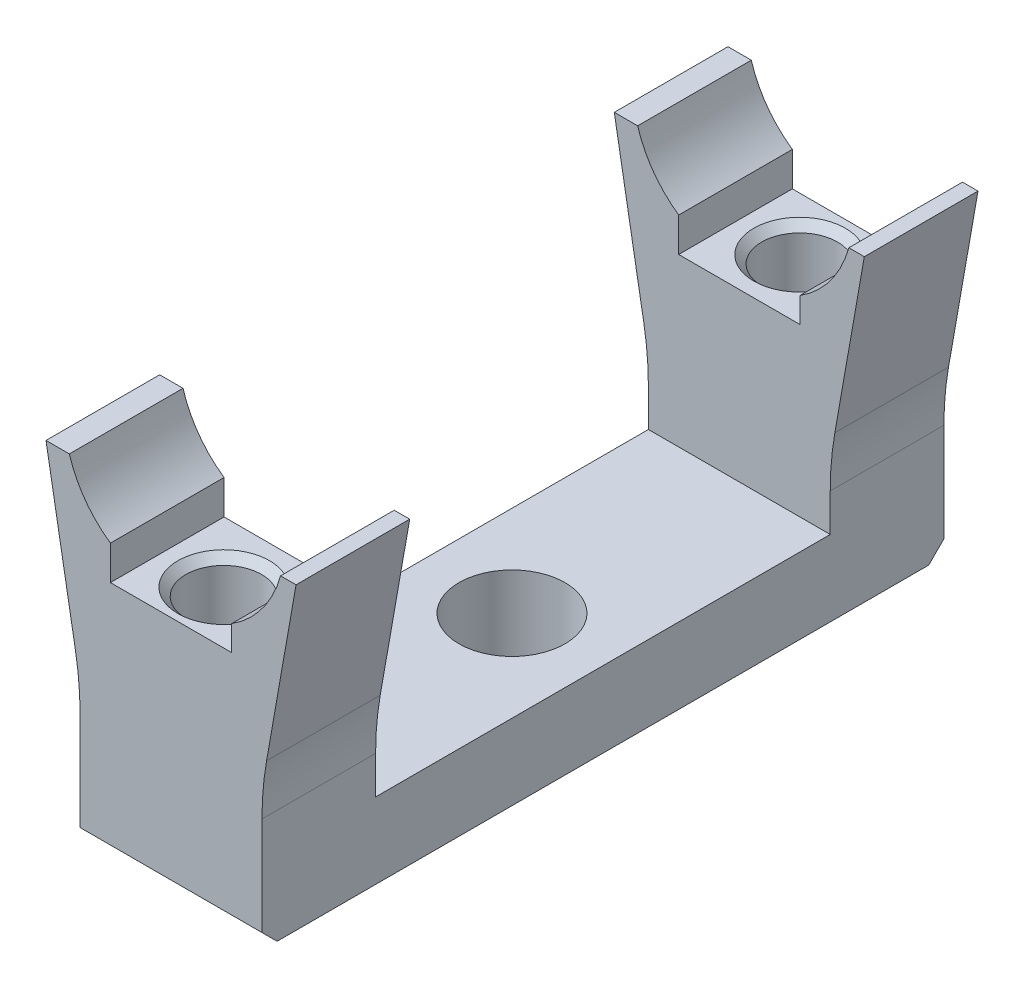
ISO-10303-21;
HEADER;
FILE_DESCRIPTION(('STEP AP214'),'2;1');
FILE_NAME('part.step','',(''),(''),'','','');
FILE_SCHEMA(('AUTOMOTIVE_DESIGN { 1 0 10303 214 1 1 1 1 }'));
ENDSEC;
DATA;
#1=APPLICATION_CONTEXT('core data for automotive mechanical design processes');
#2=APPLICATION_PROTOCOL_DEFINITION('international standard','automotive_design',2000,#1);
#3=PRODUCT_CONTEXT('',#1,'mechanical');
#4=PRODUCT('Part','Part','',(#3));
#5=PRODUCT_RELATED_PRODUCT_CATEGORY('part','',(#4));
#6=PRODUCT_DEFINITION_FORMATION('','',#4);
#7=PRODUCT_DEFINITION_CONTEXT('part definition',#1,'design');
#8=PRODUCT_DEFINITION('design','',#6,#7);
#9=PRODUCT_DEFINITION_SHAPE('','',#8);
#10=(LENGTH_UNIT() NAMED_UNIT(*) SI_UNIT(.MILLI.,.METRE.));
#11=(NAMED_UNIT(*) PLANE_ANGLE_UNIT() SI_UNIT($,.RADIAN.));
#12=(NAMED_UNIT(*) SI_UNIT($,.STERADIAN.) SOLID_ANGLE_UNIT());
#13=UNCERTAINTY_MEASURE_WITH_UNIT(LENGTH_MEASURE(1.E-05),#10,'distance_accuracy_value','');
#14=(GEOMETRIC_REPRESENTATION_CONTEXT(3) GLOBAL_UNCERTAINTY_ASSIGNED_CONTEXT((#13)) GLOBAL_UNIT_ASSIGNED_CONTEXT((#10,
#11,#12)) REPRESENTATION_CONTEXT('',''));
#15=CARTESIAN_POINT('',(0.,0.,0.));
#16=DIRECTION('',(0.,0.,1.));
#17=DIRECTION('',(1.,0.,0.));
#18=AXIS2_PLACEMENT_3D('',#15,#16,#17);
#19=CARTESIAN_POINT('',(26.,7.4898426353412,45.));
#20=DIRECTION('',(0.,0.,-1.));
#21=DIRECTION('',(-1.,0.,0.));
#22=AXIS2_PLACEMENT_3D('',#19,#20,#21);
#23=CYLINDRICAL_SURFACE('',#22,20.);
#24=DIRECTION('',(0.,0.,-1.));
#25=VECTOR('',#24,1.);
#26=CARTESIAN_POINT('',(6.,7.48984263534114,45.));
#27=LINE('',#26,#25);
#28=CARTESIAN_POINT('',(6.,7.48984263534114,45.));
#29=VERTEX_POINT('',#28);
#30=CARTESIAN_POINT('',(6.,7.48984263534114,37.5));
#31=VERTEX_POINT('',#30);
#32=EDGE_CURVE('E475',#29,#31,#27,.T.);
#33=ORIENTED_EDGE('',*,*,#32,.T.);
#34=CARTESIAN_POINT('',(26.,7.4898426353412,37.5));
#35=DIRECTION('',(0.,0.,1.));
#36=DIRECTION('',(0.,-1.,0.));
#37=AXIS2_PLACEMENT_3D('',#34,#35,#36);
#38=CIRCLE('',#37,20.);
#39=CARTESIAN_POINT('',(6.30384493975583,10.9628061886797,37.5));
#40=VERTEX_POINT('',#39);
#41=EDGE_CURVE('E348',#31,#40,#38,.F.);
#42=ORIENTED_EDGE('',*,*,#41,.T.);
#43=DIRECTION('',(0.,0.,-1.));
#44=VECTOR('',#43,1.);
#45=CARTESIAN_POINT('',(6.30384493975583,10.9628061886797,45.));
#46=LINE('',#45,#44);
#47=CARTESIAN_POINT('',(6.30384493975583,10.9628061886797,45.));
#48=VERTEX_POINT('',#47);
#49=EDGE_CURVE('E471',#48,#40,#46,.T.);
#50=ORIENTED_EDGE('',*,*,#49,.F.);
#51=CARTESIAN_POINT('',(26.,7.4898426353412,45.));
#52=DIRECTION('',(0.,0.,1.));
#53=DIRECTION('',(1.,0.,0.));
#54=AXIS2_PLACEMENT_3D('',#51,#52,#53);
#55=CIRCLE('',#54,20.);
#56=EDGE_CURVE('E357',#29,#48,#55,.F.);
#57=ORIENTED_EDGE('',*,*,#56,.F.);
#58=EDGE_LOOP('',(#33,#42,#50,#57));
#59=FACE_BOUND('',#58,.T.);
#60=ADVANCED_FACE('F53',(#59),#23,.F.);
#61=CARTESIAN_POINT('',(4.23901048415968,-0.747451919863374,45.));
#62=DIRECTION('',(-0.984807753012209,0.173648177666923,0.));
#63=DIRECTION('',(-0.173648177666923,-0.984807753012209,0.));
#64=AXIS2_PLACEMENT_3D('',#61,#62,#63);
#65=PLANE('',#64);
#66=ORIENTED_EDGE('',*,*,#49,.T.);
#67=DIRECTION('',(0.173648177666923,0.984807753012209,0.));
#68=VECTOR('',#67,1.);
#69=CARTESIAN_POINT('',(4.23901048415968,-0.747451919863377,37.5));
#70=LINE('',#69,#68);
#71=CARTESIAN_POINT('',(8.25,22.,37.5));
#72=VERTEX_POINT('',#71);
#73=EDGE_CURVE('E345',#40,#72,#70,.T.);
#74=ORIENTED_EDGE('',*,*,#73,.T.);
#75=DIRECTION('',(0.,0.,-1.));
#76=VECTOR('',#75,1.);
#77=CARTESIAN_POINT('',(8.25,22.,45.));
#78=LINE('',#77,#76);
#79=CARTESIAN_POINT('',(8.25,22.,45.));
#80=VERTEX_POINT('',#79);
#81=EDGE_CURVE('E467',#80,#72,#78,.T.);
#82=ORIENTED_EDGE('',*,*,#81,.F.);
#83=DIRECTION('',(0.173648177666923,0.984807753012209,0.));
#84=VECTOR('',#83,1.);
#85=CARTESIAN_POINT('',(4.23901048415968,-0.747451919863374,45.));
#86=LINE('',#85,#84);
#87=EDGE_CURVE('E360',#48,#80,#86,.T.);
#88=ORIENTED_EDGE('',*,*,#87,.F.);
#89=EDGE_LOOP('',(#66,#74,#82,#88));
#90=FACE_BOUND('',#89,.T.);
#91=ADVANCED_FACE('F571',(#90),#65,.F.);
#92=CARTESIAN_POINT('',(0.,22.,45.));
#93=DIRECTION('',(0.,-1.,0.));
#94=DIRECTION('',(0.,0.,-1.));
#95=AXIS2_PLACEMENT_3D('',#92,#93,#94);
#96=PLANE('',#95);
#97=ORIENTED_EDGE('',*,*,#81,.T.);
#98=DIRECTION('',(-1.,0.,0.));
#99=VECTOR('',#98,1.);
#100=CARTESIAN_POINT('',(0.,22.,37.5));
#101=LINE('',#100,#99);
#102=CARTESIAN_POINT('',(7.22841614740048,22.,37.5));
#103=VERTEX_POINT('',#102);
#104=EDGE_CURVE('E342',#72,#103,#101,.T.);
#105=ORIENTED_EDGE('',*,*,#104,.T.);
#106=DIRECTION('',(0.,0.,-1.));
#107=VECTOR('',#106,1.);
#108=CARTESIAN_POINT('',(7.22841614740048,22.,45.));
#109=LINE('',#108,#107);
#110=CARTESIAN_POINT('',(7.22841614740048,22.,45.));
#111=VERTEX_POINT('',#110);
#112=EDGE_CURVE('E463',#111,#103,#109,.T.);
#113=ORIENTED_EDGE('',*,*,#112,.F.);
#114=DIRECTION('',(-1.,0.,0.));
#115=VECTOR('',#114,1.);
#116=CARTESIAN_POINT('',(0.,22.,45.));
#117=LINE('',#116,#115);
#118=EDGE_CURVE('E362',#80,#111,#117,.T.);
#119=ORIENTED_EDGE('',*,*,#118,.F.);
#120=EDGE_LOOP('',(#97,#105,#113,#119));
#121=FACE_BOUND('',#120,.T.);
#122=ADVANCED_FACE('F567',(#121),#96,.F.);
#123=CARTESIAN_POINT('',(0.,24.,45.));
#124=DIRECTION('',(0.,0.,-1.));
#125=DIRECTION('',(-1.,0.,0.));
#126=AXIS2_PLACEMENT_3D('',#123,#124,#125);
#127=CYLINDRICAL_SURFACE('',#126,7.5);
#128=CARTESIAN_POINT('',(0.,24.,37.5));
#129=DIRECTION('',(0.,0.,1.));
#130=DIRECTION('',(0.,-1.,0.));
#131=AXIS2_PLACEMENT_3D('',#128,#129,#130);
#132=CIRCLE('',#131,7.5);
#133=CARTESIAN_POINT('',(4.00000000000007,17.6557112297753,37.5));
#134=VERTEX_POINT('',#133);
#135=EDGE_CURVE('E340',#134,#103,#132,.T.);
#136=ORIENTED_EDGE('',*,*,#135,.F.);
#137=DIRECTION('',(0.,0.,-1.));
#138=VECTOR('',#137,1.);
#139=CARTESIAN_POINT('',(4.00000000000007,17.6557112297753,45.));
#140=LINE('',#139,#138);
#141=CARTESIAN_POINT('',(4.00000000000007,17.6557112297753,45.));
#142=VERTEX_POINT('',#141);
#143=EDGE_CURVE('E459',#142,#134,#140,.T.);
#144=ORIENTED_EDGE('',*,*,#143,.F.);
#145=CARTESIAN_POINT('',(0.,24.,45.));
#146=DIRECTION('',(0.,0.,1.));
#147=DIRECTION('',(1.,0.,0.));
#148=AXIS2_PLACEMENT_3D('',#145,#146,#147);
#149=CIRCLE('',#148,7.5);
#150=EDGE_CURVE('E364',#142,#111,#149,.T.);
#151=ORIENTED_EDGE('',*,*,#150,.T.);
#152=ORIENTED_EDGE('',*,*,#112,.T.);
#153=EDGE_LOOP('',(#136,#144,#151,#152));
#154=FACE_BOUND('',#153,.T.);
#155=ADVANCED_FACE('F565',(#154),#127,.F.);
#156=CARTESIAN_POINT('',(3.99999999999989,0.,45.));
#157=DIRECTION('',(-1.,0.,0.));
#158=DIRECTION('',(0.,-1.,0.));
#159=AXIS2_PLACEMENT_3D('',#156,#157,#158);
#160=PLANE('',#159);
#161=DIRECTION('',(0.,1.,0.));
#162=VECTOR('',#161,1.);
#163=CARTESIAN_POINT('',(3.99999999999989,0.,37.5));
#164=LINE('',#163,#162);
#165=CARTESIAN_POINT('',(4.00000000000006,16.,37.5));
#166=VERTEX_POINT('',#165);
#167=EDGE_CURVE('E338',#166,#134,#164,.T.);
#168=ORIENTED_EDGE('',*,*,#167,.F.);
#169=DIRECTION('',(0.,0.,-1.));
#170=VECTOR('',#169,1.);
#171=CARTESIAN_POINT('',(4.00000000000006,16.,45.));
#172=LINE('',#171,#170);
#173=CARTESIAN_POINT('',(4.00000000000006,16.,45.));
#174=VERTEX_POINT('',#173);
#175=EDGE_CURVE('E455',#174,#166,#172,.T.);
#176=ORIENTED_EDGE('',*,*,#175,.F.);
#177=DIRECTION('',(0.,1.,0.));
#178=VECTOR('',#177,1.);
#179=CARTESIAN_POINT('',(3.99999999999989,0.,45.));
#180=LINE('',#179,#178);
#181=EDGE_CURVE('E367',#174,#142,#180,.T.);
#182=ORIENTED_EDGE('',*,*,#181,.T.);
#183=ORIENTED_EDGE('',*,*,#143,.T.);
#184=EDGE_LOOP('',(#168,#176,#182,#183));
#185=FACE_BOUND('',#184,.T.);
#186=ADVANCED_FACE('F559',(#185),#160,.T.);
#187=CARTESIAN_POINT('',(0.,16.,45.));
#188=DIRECTION('',(0.,1.,0.));
#189=DIRECTION('',(-1.,0.,0.));
#190=AXIS2_PLACEMENT_3D('',#187,#188,#189);
#191=PLANE('',#190);
#192=CARTESIAN_POINT('',(0.,16.,41.5211454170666));
#193=DIRECTION('',(0.,1.,0.));
#194=DIRECTION('',(0.,0.,1.));
#195=AXIS2_PLACEMENT_3D('',#192,#193,#194);
#196=CIRCLE('',#195,3.025);
#197=CARTESIAN_POINT('',(0.,16.,44.5461454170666));
#198=VERTEX_POINT('',#197);
#199=EDGE_CURVE('E274',#198,#198,#196,.T.);
#200=ORIENTED_EDGE('',*,*,#199,.F.);
#201=EDGE_LOOP('',(#200));
#202=FACE_BOUND('',#201,.T.);
#203=DIRECTION('',(1.,0.,0.));
#204=VECTOR('',#203,1.);
#205=CARTESIAN_POINT('',(0.,16.,37.5));
#206=LINE('',#205,#204);
#207=CARTESIAN_POINT('',(-3.99999999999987,16.,37.5));
#208=VERTEX_POINT('',#207);
#209=EDGE_CURVE('E336',#208,#166,#206,.T.);
#210=ORIENTED_EDGE('',*,*,#209,.F.);
#211=DIRECTION('',(0.,0.,-1.));
#212=VECTOR('',#211,1.);
#213=CARTESIAN_POINT('',(-3.99999999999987,16.,45.));
#214=LINE('',#213,#212);
#215=CARTESIAN_POINT('',(-3.99999999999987,16.,45.));
#216=VERTEX_POINT('',#215);
#217=EDGE_CURVE('E451',#216,#208,#214,.T.);
#218=ORIENTED_EDGE('',*,*,#217,.F.);
#219=DIRECTION('',(1.,0.,0.));
#220=VECTOR('',#219,1.);
#221=CARTESIAN_POINT('',(0.,16.,45.));
#222=LINE('',#221,#220);
#223=EDGE_CURVE('E370',#216,#174,#222,.T.);
#224=ORIENTED_EDGE('',*,*,#223,.T.);
#225=ORIENTED_EDGE('',*,*,#175,.T.);
#226=EDGE_LOOP('',(#210,#218,#224,#225));
#227=FACE_BOUND('',#226,.T.);
#228=ADVANCED_FACE('F557',(#202,#227),#191,.T.);
#229=CARTESIAN_POINT('',(-3.99999999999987,0.,45.));
#230=DIRECTION('',(-1.,0.,0.));
#231=DIRECTION('',(0.,0.,1.));
#232=AXIS2_PLACEMENT_3D('',#229,#230,#231);
#233=PLANE('',#232);
#234=ORIENTED_EDGE('',*,*,#217,.T.);
#235=DIRECTION('',(0.,1.,0.));
#236=VECTOR('',#235,1.);
#237=CARTESIAN_POINT('',(-3.99999999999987,0.,37.5));
#238=LINE('',#237,#236);
#239=CARTESIAN_POINT('',(-3.99999999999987,18.2554373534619,37.5));
#240=VERTEX_POINT('',#239);
#241=EDGE_CURVE('E333',#208,#240,#238,.T.);
#242=ORIENTED_EDGE('',*,*,#241,.T.);
#243=DIRECTION('',(0.,0.,-1.));
#244=VECTOR('',#243,1.);
#245=CARTESIAN_POINT('',(-3.99999999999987,18.2554373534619,45.));
#246=LINE('',#245,#244);
#247=CARTESIAN_POINT('',(-3.99999999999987,18.2554373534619,45.));
#248=VERTEX_POINT('',#247);
#249=EDGE_CURVE('E447',#248,#240,#246,.T.);
#250=ORIENTED_EDGE('',*,*,#249,.F.);
#251=DIRECTION('',(0.,1.,0.));
#252=VECTOR('',#251,1.);
#253=CARTESIAN_POINT('',(-3.99999999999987,0.,45.));
#254=LINE('',#253,#252);
#255=EDGE_CURVE('E373',#216,#248,#254,.T.);
#256=ORIENTED_EDGE('',*,*,#255,.F.);
#257=EDGE_LOOP('',(#234,#242,#250,#256));
#258=FACE_BOUND('',#257,.T.);
#259=ADVANCED_FACE('F553',(#258),#233,.F.);
#260=CARTESIAN_POINT('',(0.,24.,45.));
#261=DIRECTION('',(0.,0.,-1.));
#262=DIRECTION('',(-1.,0.,0.));
#263=AXIS2_PLACEMENT_3D('',#260,#261,#262);
#264=CYLINDRICAL_SURFACE('',#263,7.);
#265=CARTESIAN_POINT('',(0.,24.,37.5));
#266=DIRECTION('',(0.,0.,1.));
#267=DIRECTION('',(0.,-1.,0.));
#268=AXIS2_PLACEMENT_3D('',#265,#266,#267);
#269=CIRCLE('',#268,7.);
#270=CARTESIAN_POINT('',(-6.70820393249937,22.,37.5));
#271=VERTEX_POINT('',#270);
#272=EDGE_CURVE('E331',#271,#240,#269,.T.);
#273=ORIENTED_EDGE('',*,*,#272,.F.);
#274=DIRECTION('',(0.,0.,-1.));
#275=VECTOR('',#274,1.);
#276=CARTESIAN_POINT('',(-6.70820393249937,22.,45.));
#277=LINE('',#276,#275);
#278=CARTESIAN_POINT('',(-6.70820393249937,22.,45.));
#279=VERTEX_POINT('',#278);
#280=EDGE_CURVE('E443',#279,#271,#277,.T.);
#281=ORIENTED_EDGE('',*,*,#280,.F.);
#282=CARTESIAN_POINT('',(0.,24.,45.));
#283=DIRECTION('',(0.,0.,1.));
#284=DIRECTION('',(1.,0.,0.));
#285=AXIS2_PLACEMENT_3D('',#282,#283,#284);
#286=CIRCLE('',#285,7.);
#287=EDGE_CURVE('E375',#279,#248,#286,.T.);
#288=ORIENTED_EDGE('',*,*,#287,.T.);
#289=ORIENTED_EDGE('',*,*,#249,.T.);
#290=EDGE_LOOP('',(#273,#281,#288,#289));
#291=FACE_BOUND('',#290,.T.);
#292=ADVANCED_FACE('F547',(#291),#264,.F.);
#293=CARTESIAN_POINT('',(0.,22.,45.));
#294=DIRECTION('',(0.,1.,0.));
#295=DIRECTION('',(0.,0.,1.));
#296=AXIS2_PLACEMENT_3D('',#293,#294,#295);
#297=PLANE('',#296);
#298=DIRECTION('',(1.,0.,0.));
#299=VECTOR('',#298,1.);
#300=CARTESIAN_POINT('',(0.,22.,37.5));
#301=LINE('',#300,#299);
#302=CARTESIAN_POINT('',(-8.25,22.,37.5));
#303=VERTEX_POINT('',#302);
#304=EDGE_CURVE('E329',#303,#271,#301,.T.);
#305=ORIENTED_EDGE('',*,*,#304,.F.);
#306=DIRECTION('',(0.,0.,-1.));
#307=VECTOR('',#306,1.);
#308=CARTESIAN_POINT('',(-8.25,22.,45.));
#309=LINE('',#308,#307);
#310=CARTESIAN_POINT('',(-8.25,22.,45.));
#311=VERTEX_POINT('',#310);
#312=EDGE_CURVE('E439',#311,#303,#309,.T.);
#313=ORIENTED_EDGE('',*,*,#312,.F.);
#314=DIRECTION('',(1.,0.,0.));
#315=VECTOR('',#314,1.);
#316=CARTESIAN_POINT('',(0.,22.,45.));
#317=LINE('',#316,#315);
#318=EDGE_CURVE('E378',#311,#279,#317,.T.);
#319=ORIENTED_EDGE('',*,*,#318,.T.);
#320=ORIENTED_EDGE('',*,*,#280,.T.);
#321=EDGE_LOOP('',(#305,#313,#319,#320));
#322=FACE_BOUND('',#321,.T.);
#323=ADVANCED_FACE('F545',(#322),#297,.T.);
#324=CARTESIAN_POINT('',(-4.23901048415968,-0.747451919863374,45.));
#325=DIRECTION('',(-0.984807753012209,-0.173648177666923,0.));
#326=DIRECTION('',(0.173648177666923,-0.984807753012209,0.));
#327=AXIS2_PLACEMENT_3D('',#324,#325,#326);
#328=PLANE('',#327);
#329=DIRECTION('',(-0.173648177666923,0.984807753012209,0.));
#330=VECTOR('',#329,1.);
#331=CARTESIAN_POINT('',(-4.23901048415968,-0.747451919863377,37.5));
#332=LINE('',#331,#330);
#333=CARTESIAN_POINT('',(-6.30384493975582,10.9628061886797,37.5));
#334=VERTEX_POINT('',#333);
#335=EDGE_CURVE('E327',#334,#303,#332,.T.);
#336=ORIENTED_EDGE('',*,*,#335,.F.);
#337=DIRECTION('',(0.,0.,-1.));
#338=VECTOR('',#337,1.);
#339=CARTESIAN_POINT('',(-6.30384493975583,10.9628061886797,45.));
#340=LINE('',#339,#338);
#341=CARTESIAN_POINT('',(-6.30384493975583,10.9628061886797,45.));
#342=VERTEX_POINT('',#341);
#343=EDGE_CURVE('E435',#342,#334,#340,.T.);
#344=ORIENTED_EDGE('',*,*,#343,.F.);
#345=DIRECTION('',(-0.173648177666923,0.984807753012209,0.));
#346=VECTOR('',#345,1.);
#347=CARTESIAN_POINT('',(-4.23901048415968,-0.747451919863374,45.));
#348=LINE('',#347,#346);
#349=EDGE_CURVE('E381',#342,#311,#348,.T.);
#350=ORIENTED_EDGE('',*,*,#349,.T.);
#351=ORIENTED_EDGE('',*,*,#312,.T.);
#352=EDGE_LOOP('',(#336,#344,#350,#351));
#353=FACE_BOUND('',#352,.T.);
#354=ADVANCED_FACE('F541',(#353),#328,.T.);
#355=CARTESIAN_POINT('',(-26.,7.4898426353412,45.));
#356=DIRECTION('',(0.,0.,-1.));
#357=DIRECTION('',(-1.,0.,0.));
#358=AXIS2_PLACEMENT_3D('',#355,#356,#357);
#359=CYLINDRICAL_SURFACE('',#358,20.);
#360=CARTESIAN_POINT('',(-26.,7.4898426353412,37.5));
#361=DIRECTION('',(0.,0.,1.));
#362=DIRECTION('',(0.,-1.,0.));
#363=AXIS2_PLACEMENT_3D('',#360,#361,#362);
#364=CIRCLE('',#363,20.);
#365=CARTESIAN_POINT('',(-6.,7.48984263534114,37.5));
#366=VERTEX_POINT('',#365);
#367=EDGE_CURVE('E325',#366,#334,#364,.T.);
#368=ORIENTED_EDGE('',*,*,#367,.F.);
#369=DIRECTION('',(0.,0.,-1.));
#370=VECTOR('',#369,1.);
#371=CARTESIAN_POINT('',(-6.,7.48984263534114,45.));
#372=LINE('',#371,#370);
#373=CARTESIAN_POINT('',(-6.,7.48984263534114,45.));
#374=VERTEX_POINT('',#373);
#375=EDGE_CURVE('E431',#374,#366,#372,.T.);
#376=ORIENTED_EDGE('',*,*,#375,.F.);
#377=CARTESIAN_POINT('',(-26.,7.4898426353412,45.));
#378=DIRECTION('',(0.,0.,1.));
#379=DIRECTION('',(1.,0.,0.));
#380=AXIS2_PLACEMENT_3D('',#377,#378,#379);
#381=CIRCLE('',#380,20.);
#382=EDGE_CURVE('E384',#374,#342,#381,.T.);
#383=ORIENTED_EDGE('',*,*,#382,.T.);
#384=ORIENTED_EDGE('',*,*,#343,.T.);
#385=EDGE_LOOP('',(#368,#376,#383,#384));
#386=FACE_BOUND('',#385,.T.);
#387=ADVANCED_FACE('F532',(#386),#359,.F.);
#388=CARTESIAN_POINT('',(6.,0.,45.));
#389=DIRECTION('',(-1.,0.,0.));
#390=DIRECTION('',(0.,0.,1.));
#391=AXIS2_PLACEMENT_3D('',#388,#389,#390);
#392=PLANE('',#391);
#393=DIRECTION('',(0.,0.,-1.));
#394=VECTOR('',#393,1.);
#395=CARTESIAN_POINT('',(6.,0.,45.));
#396=LINE('',#395,#394);
#397=CARTESIAN_POINT('',(6.,0.,44.));
#398=VERTEX_POINT('',#397);
#399=CARTESIAN_POINT('',(6.,0.,1.00000000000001));
#400=VERTEX_POINT('',#399);
#401=EDGE_CURVE('E389',#398,#400,#396,.T.);
#402=ORIENTED_EDGE('',*,*,#401,.T.);
#403=DIRECTION('',(0.,-0.707106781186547,0.707106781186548));
#404=VECTOR('',#403,1.);
#405=CARTESIAN_POINT('',(6.,0.,1.));
#406=LINE('',#405,#404);
#407=CARTESIAN_POINT('',(6.,1.,0.));
#408=VERTEX_POINT('',#407);
#409=EDGE_CURVE('E494',#400,#408,#406,.F.);
#410=ORIENTED_EDGE('',*,*,#409,.T.);
#411=DIRECTION('',(0.,1.,0.));
#412=VECTOR('',#411,1.);
#413=CARTESIAN_POINT('',(6.,0.,0.));
#414=LINE('',#413,#412);
#415=CARTESIAN_POINT('',(6.,7.48984263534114,0.));
#416=VERTEX_POINT('',#415);
#417=EDGE_CURVE('E354',#408,#416,#414,.T.);
#418=ORIENTED_EDGE('',*,*,#417,.T.);
#419=CARTESIAN_POINT('',(6.,7.48984263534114,7.50000000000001));
#420=VERTEX_POINT('',#419);
#421=EDGE_CURVE('E474',#420,#416,#27,.T.);
#422=ORIENTED_EDGE('',*,*,#421,.F.);
#423=DIRECTION('',(0.,-1.,0.));
#424=VECTOR('',#423,1.);
#425=CARTESIAN_POINT('',(6.,0.,7.5));
#426=LINE('',#425,#424);
#427=CARTESIAN_POINT('',(5.99999999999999,5.,7.5));
#428=VERTEX_POINT('',#427);
#429=EDGE_CURVE('E322',#420,#428,#426,.T.);
#430=ORIENTED_EDGE('',*,*,#429,.T.);
#431=DIRECTION('',(0.,0.,1.));
#432=VECTOR('',#431,1.);
#433=CARTESIAN_POINT('',(6.,5.,45.));
#434=LINE('',#433,#432);
#435=CARTESIAN_POINT('',(5.99999999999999,5.,37.5));
#436=VERTEX_POINT('',#435);
#437=EDGE_CURVE('E291',#428,#436,#434,.T.);
#438=ORIENTED_EDGE('',*,*,#437,.T.);
#439=DIRECTION('',(0.,1.,0.));
#440=VECTOR('',#439,1.);
#441=CARTESIAN_POINT('',(6.,0.,37.5));
#442=LINE('',#441,#440);
#443=EDGE_CURVE('E351',#436,#31,#442,.T.);
#444=ORIENTED_EDGE('',*,*,#443,.T.);
#445=ORIENTED_EDGE('',*,*,#32,.F.);
#446=DIRECTION('',(0.,1.,0.));
#447=VECTOR('',#446,1.);
#448=CARTESIAN_POINT('',(6.,0.,45.));
#449=LINE('',#448,#447);
#450=CARTESIAN_POINT('',(6.,1.,45.));
#451=VERTEX_POINT('',#450);
#452=EDGE_CURVE('E355',#451,#29,#449,.T.);
#453=ORIENTED_EDGE('',*,*,#452,.F.);
#454=DIRECTION('',(0.,-0.707106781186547,-0.707106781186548));
#455=VECTOR('',#454,1.);
#456=CARTESIAN_POINT('',(6.,1.,45.));
#457=LINE('',#456,#455);
#458=EDGE_CURVE('E492',#451,#398,#457,.T.);
#459=ORIENTED_EDGE('',*,*,#458,.T.);
#460=EDGE_LOOP('',(#402,#410,#418,#422,#430,#438,#444,#445,#453,#459));
#461=FACE_BOUND('',#460,.T.);
#462=ADVANCED_FACE('F508',(#461),#392,.F.);
#463=CARTESIAN_POINT('',(6.30384493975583,10.9628061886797,7.5));
#464=VERTEX_POINT('',#463);
#465=CARTESIAN_POINT('',(6.30384493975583,10.9628061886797,0.));
#466=VERTEX_POINT('',#465);
#467=EDGE_CURVE('E470',#464,#466,#46,.T.);
#468=ORIENTED_EDGE('',*,*,#467,.F.);
#469=CARTESIAN_POINT('',(26.,7.4898426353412,7.50000000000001));
#470=DIRECTION('',(0.,0.,-1.));
#471=DIRECTION('',(0.,1.,0.));
#472=AXIS2_PLACEMENT_3D('',#469,#470,#471);
#473=CIRCLE('',#472,20.);
#474=EDGE_CURVE('E319',#464,#420,#473,.F.);
#475=ORIENTED_EDGE('',*,*,#474,.T.);
#476=ORIENTED_EDGE('',*,*,#421,.T.);
#477=CARTESIAN_POINT('',(26.,7.4898426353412,0.));
#478=DIRECTION('',(0.,0.,1.));
#479=DIRECTION('',(1.,0.,0.));
#480=AXIS2_PLACEMENT_3D('',#477,#478,#479);
#481=CIRCLE('',#480,20.);
#482=EDGE_CURVE('E391',#416,#466,#481,.F.);
#483=ORIENTED_EDGE('',*,*,#482,.T.);
#484=EDGE_LOOP('',(#468,#475,#476,#483));
#485=FACE_BOUND('',#484,.T.);
#486=ADVANCED_FACE('F517',(#485),#23,.F.);
#487=CARTESIAN_POINT('',(8.25,22.,7.50000000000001));
#488=VERTEX_POINT('',#487);
#489=CARTESIAN_POINT('',(8.25,22.,0.));
#490=VERTEX_POINT('',#489);
#491=EDGE_CURVE('E466',#488,#490,#78,.T.);
#492=ORIENTED_EDGE('',*,*,#491,.F.);
#493=DIRECTION('',(-0.173648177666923,-0.984807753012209,0.));
#494=VECTOR('',#493,1.);
#495=CARTESIAN_POINT('',(4.23901048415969,-0.747451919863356,7.49999999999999));
#496=LINE('',#495,#494);
#497=EDGE_CURVE('E316',#488,#464,#496,.T.);
#498=ORIENTED_EDGE('',*,*,#497,.T.);
#499=ORIENTED_EDGE('',*,*,#467,.T.);
#500=DIRECTION('',(0.173648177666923,0.984807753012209,0.));
#501=VECTOR('',#500,1.);
#502=CARTESIAN_POINT('',(4.23901048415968,-0.747451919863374,0.));
#503=LINE('',#502,#501);
#504=EDGE_CURVE('E394',#466,#490,#503,.T.);
#505=ORIENTED_EDGE('',*,*,#504,.T.);
#506=EDGE_LOOP('',(#492,#498,#499,#505));
#507=FACE_BOUND('',#506,.T.);
#508=ADVANCED_FACE('F589',(#507),#65,.F.);
#509=CARTESIAN_POINT('',(7.22841614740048,22.,7.50000000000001));
#510=VERTEX_POINT('',#509);
#511=CARTESIAN_POINT('',(7.22841614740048,22.,0.));
#512=VERTEX_POINT('',#511);
#513=EDGE_CURVE('E462',#510,#512,#109,.T.);
#514=ORIENTED_EDGE('',*,*,#513,.F.);
#515=DIRECTION('',(1.,0.,0.));
#516=VECTOR('',#515,1.);
#517=CARTESIAN_POINT('',(0.,22.,7.50000000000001));
#518=LINE('',#517,#516);
#519=EDGE_CURVE('E313',#510,#488,#518,.T.);
#520=ORIENTED_EDGE('',*,*,#519,.T.);
#521=ORIENTED_EDGE('',*,*,#491,.T.);
#522=DIRECTION('',(-1.,0.,0.));
#523=VECTOR('',#522,1.);
#524=CARTESIAN_POINT('',(0.,22.,0.));
#525=LINE('',#524,#523);
#526=EDGE_CURVE('E397',#490,#512,#525,.T.);
#527=ORIENTED_EDGE('',*,*,#526,.T.);
#528=EDGE_LOOP('',(#514,#520,#521,#527));
#529=FACE_BOUND('',#528,.T.);
#530=ADVANCED_FACE('F596',(#529),#96,.F.);
#531=CARTESIAN_POINT('',(0.,24.,7.50000000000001));
#532=DIRECTION('',(0.,0.,-1.));
#533=DIRECTION('',(0.,1.,0.));
#534=AXIS2_PLACEMENT_3D('',#531,#532,#533);
#535=CIRCLE('',#534,7.5);
#536=CARTESIAN_POINT('',(4.00000000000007,17.6557112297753,7.50000000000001));
#537=VERTEX_POINT('',#536);
#538=EDGE_CURVE('E311',#510,#537,#535,.T.);
#539=ORIENTED_EDGE('',*,*,#538,.F.);
#540=ORIENTED_EDGE('',*,*,#513,.T.);
#541=CARTESIAN_POINT('',(0.,24.,0.));
#542=DIRECTION('',(0.,0.,1.));
#543=DIRECTION('',(1.,0.,0.));
#544=AXIS2_PLACEMENT_3D('',#541,#542,#543);
#545=CIRCLE('',#544,7.5);
#546=CARTESIAN_POINT('',(4.00000000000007,17.6557112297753,0.));
#547=VERTEX_POINT('',#546);
#548=EDGE_CURVE('E400',#547,#512,#545,.T.);
#549=ORIENTED_EDGE('',*,*,#548,.F.);
#550=EDGE_CURVE('E458',#537,#547,#140,.T.);
#551=ORIENTED_EDGE('',*,*,#550,.F.);
#552=EDGE_LOOP('',(#539,#540,#549,#551));
#553=FACE_BOUND('',#552,.T.);
#554=ADVANCED_FACE('F657',(#553),#127,.F.);
#555=DIRECTION('',(0.,-1.,0.));
#556=VECTOR('',#555,1.);
#557=CARTESIAN_POINT('',(3.99999999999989,0.,7.5));
#558=LINE('',#557,#556);
#559=CARTESIAN_POINT('',(4.00000000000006,16.,7.50000000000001));
#560=VERTEX_POINT('',#559);
#561=EDGE_CURVE('E309',#537,#560,#558,.T.);
#562=ORIENTED_EDGE('',*,*,#561,.F.);
#563=ORIENTED_EDGE('',*,*,#550,.T.);
#564=DIRECTION('',(0.,1.,0.));
#565=VECTOR('',#564,1.);
#566=CARTESIAN_POINT('',(3.99999999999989,0.,0.));
#567=LINE('',#566,#565);
#568=CARTESIAN_POINT('',(4.00000000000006,16.,0.));
#569=VERTEX_POINT('',#568);
#570=EDGE_CURVE('E403',#569,#547,#567,.T.);
#571=ORIENTED_EDGE('',*,*,#570,.F.);
#572=EDGE_CURVE('E454',#560,#569,#172,.T.);
#573=ORIENTED_EDGE('',*,*,#572,.F.);
#574=EDGE_LOOP('',(#562,#563,#571,#573));
#575=FACE_BOUND('',#574,.T.);
#576=ADVANCED_FACE('F652',(#575),#160,.T.);
#577=CARTESIAN_POINT('',(0.,16.,3.52114541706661));
#578=DIRECTION('',(0.,1.,0.));
#579=DIRECTION('',(0.,0.,1.));
#580=AXIS2_PLACEMENT_3D('',#577,#578,#579);
#581=CIRCLE('',#580,3.025);
#582=CARTESIAN_POINT('',(0.,16.,6.54614541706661));
#583=VERTEX_POINT('',#582);
#584=EDGE_CURVE('E267',#583,#583,#581,.T.);
#585=ORIENTED_EDGE('',*,*,#584,.F.);
#586=EDGE_LOOP('',(#585));
#587=FACE_BOUND('',#586,.T.);
#588=DIRECTION('',(-1.,0.,0.));
#589=VECTOR('',#588,1.);
#590=CARTESIAN_POINT('',(0.,16.,7.50000000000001));
#591=LINE('',#590,#589);
#592=CARTESIAN_POINT('',(-3.99999999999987,16.,7.50000000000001));
#593=VERTEX_POINT('',#592);
#594=EDGE_CURVE('E307',#560,#593,#591,.T.);
#595=ORIENTED_EDGE('',*,*,#594,.F.);
#596=ORIENTED_EDGE('',*,*,#572,.T.);
#597=DIRECTION('',(1.,0.,0.));
#598=VECTOR('',#597,1.);
#599=CARTESIAN_POINT('',(0.,16.,0.));
#600=LINE('',#599,#598);
#601=CARTESIAN_POINT('',(-3.99999999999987,16.,0.));
#602=VERTEX_POINT('',#601);
#603=EDGE_CURVE('E406',#602,#569,#600,.T.);
#604=ORIENTED_EDGE('',*,*,#603,.F.);
#605=EDGE_CURVE('E450',#593,#602,#214,.T.);
#606=ORIENTED_EDGE('',*,*,#605,.F.);
#607=EDGE_LOOP('',(#595,#596,#604,#606));
#608=FACE_BOUND('',#607,.T.);
#609=ADVANCED_FACE('F647',(#587,#608),#191,.T.);
#610=CARTESIAN_POINT('',(-3.99999999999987,18.2554373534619,7.50000000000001));
#611=VERTEX_POINT('',#610);
#612=CARTESIAN_POINT('',(-3.99999999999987,18.2554373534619,0.));
#613=VERTEX_POINT('',#612);
#614=EDGE_CURVE('E446',#611,#613,#246,.T.);
#615=ORIENTED_EDGE('',*,*,#614,.F.);
#616=DIRECTION('',(0.,-1.,0.));
#617=VECTOR('',#616,1.);
#618=CARTESIAN_POINT('',(-3.99999999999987,0.,7.5));
#619=LINE('',#618,#617);
#620=EDGE_CURVE('E304',#611,#593,#619,.T.);
#621=ORIENTED_EDGE('',*,*,#620,.T.);
#622=ORIENTED_EDGE('',*,*,#605,.T.);
#623=DIRECTION('',(0.,1.,0.));
#624=VECTOR('',#623,1.);
#625=CARTESIAN_POINT('',(-3.99999999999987,0.,0.));
#626=LINE('',#625,#624);
#627=EDGE_CURVE('E409',#602,#613,#626,.T.);
#628=ORIENTED_EDGE('',*,*,#627,.T.);
#629=EDGE_LOOP('',(#615,#621,#622,#628));
#630=FACE_BOUND('',#629,.T.);
#631=ADVANCED_FACE('F642',(#630),#233,.F.);
#632=CARTESIAN_POINT('',(0.,24.,7.50000000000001));
#633=DIRECTION('',(0.,0.,-1.));
#634=DIRECTION('',(0.,1.,0.));
#635=AXIS2_PLACEMENT_3D('',#632,#633,#634);
#636=CIRCLE('',#635,7.);
#637=CARTESIAN_POINT('',(-6.70820393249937,22.,7.50000000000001));
#638=VERTEX_POINT('',#637);
#639=EDGE_CURVE('E302',#611,#638,#636,.T.);
#640=ORIENTED_EDGE('',*,*,#639,.F.);
#641=ORIENTED_EDGE('',*,*,#614,.T.);
#642=CARTESIAN_POINT('',(0.,24.,0.));
#643=DIRECTION('',(0.,0.,1.));
#644=DIRECTION('',(1.,0.,0.));
#645=AXIS2_PLACEMENT_3D('',#642,#643,#644);
#646=CIRCLE('',#645,7.);
#647=CARTESIAN_POINT('',(-6.70820393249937,22.,0.));
#648=VERTEX_POINT('',#647);
#649=EDGE_CURVE('E412',#648,#613,#646,.T.);
#650=ORIENTED_EDGE('',*,*,#649,.F.);
#651=EDGE_CURVE('E442',#638,#648,#277,.T.);
#652=ORIENTED_EDGE('',*,*,#651,.F.);
#653=EDGE_LOOP('',(#640,#641,#650,#652));
#654=FACE_BOUND('',#653,.T.);
#655=ADVANCED_FACE('F639',(#654),#264,.F.);
#656=DIRECTION('',(-1.,0.,0.));
#657=VECTOR('',#656,1.);
#658=CARTESIAN_POINT('',(0.,22.,7.50000000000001));
#659=LINE('',#658,#657);
#660=CARTESIAN_POINT('',(-8.25,22.,7.5));
#661=VERTEX_POINT('',#660);
#662=EDGE_CURVE('E300',#638,#661,#659,.T.);
#663=ORIENTED_EDGE('',*,*,#662,.F.);
#664=ORIENTED_EDGE('',*,*,#651,.T.);
#665=DIRECTION('',(1.,0.,0.));
#666=VECTOR('',#665,1.);
#667=CARTESIAN_POINT('',(0.,22.,0.));
#668=LINE('',#667,#666);
#669=CARTESIAN_POINT('',(-8.25,22.,0.));
#670=VERTEX_POINT('',#669);
#671=EDGE_CURVE('E415',#670,#648,#668,.T.);
#672=ORIENTED_EDGE('',*,*,#671,.F.);
#673=EDGE_CURVE('E438',#661,#670,#309,.T.);
#674=ORIENTED_EDGE('',*,*,#673,.F.);
#675=EDGE_LOOP('',(#663,#664,#672,#674));
#676=FACE_BOUND('',#675,.T.);
#677=ADVANCED_FACE('F622',(#676),#297,.T.);
#678=DIRECTION('',(0.173648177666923,-0.984807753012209,0.));
#679=VECTOR('',#678,1.);
#680=CARTESIAN_POINT('',(-4.23901048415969,-0.747451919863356,7.49999999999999));
#681=LINE('',#680,#679);
#682=CARTESIAN_POINT('',(-6.30384493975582,10.9628061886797,7.50000000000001));
#683=VERTEX_POINT('',#682);
#684=EDGE_CURVE('E298',#661,#683,#681,.T.);
#685=ORIENTED_EDGE('',*,*,#684,.F.);
#686=ORIENTED_EDGE('',*,*,#673,.T.);
#687=DIRECTION('',(-0.173648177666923,0.984807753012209,0.));
#688=VECTOR('',#687,1.);
#689=CARTESIAN_POINT('',(-4.23901048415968,-0.747451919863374,0.));
#690=LINE('',#689,#688);
#691=CARTESIAN_POINT('',(-6.30384493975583,10.9628061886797,0.));
#692=VERTEX_POINT('',#691);
#693=EDGE_CURVE('E418',#692,#670,#690,.T.);
#694=ORIENTED_EDGE('',*,*,#693,.F.);
#695=EDGE_CURVE('E434',#683,#692,#340,.T.);
#696=ORIENTED_EDGE('',*,*,#695,.F.);
#697=EDGE_LOOP('',(#685,#686,#694,#696));
#698=FACE_BOUND('',#697,.T.);
#699=ADVANCED_FACE('F614',(#698),#328,.T.);
#700=CARTESIAN_POINT('',(-26.,7.4898426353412,7.50000000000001));
#701=DIRECTION('',(0.,0.,-1.));
#702=DIRECTION('',(0.,1.,0.));
#703=AXIS2_PLACEMENT_3D('',#700,#701,#702);
#704=CIRCLE('',#703,20.);
#705=CARTESIAN_POINT('',(-6.,7.48984263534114,7.5));
#706=VERTEX_POINT('',#705);
#707=EDGE_CURVE('E296',#683,#706,#704,.T.);
#708=ORIENTED_EDGE('',*,*,#707,.F.);
#709=ORIENTED_EDGE('',*,*,#695,.T.);
#710=CARTESIAN_POINT('',(-26.,7.4898426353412,0.));
#711=DIRECTION('',(0.,0.,1.));
#712=DIRECTION('',(1.,0.,0.));
#713=AXIS2_PLACEMENT_3D('',#710,#711,#712);
#714=CIRCLE('',#713,20.);
#715=CARTESIAN_POINT('',(-6.,7.48984263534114,0.));
#716=VERTEX_POINT('',#715);
#717=EDGE_CURVE('E421',#716,#692,#714,.T.);
#718=ORIENTED_EDGE('',*,*,#717,.F.);
#719=EDGE_CURVE('E430',#706,#716,#372,.T.);
#720=ORIENTED_EDGE('',*,*,#719,.F.);
#721=EDGE_LOOP('',(#708,#709,#718,#720));
#722=FACE_BOUND('',#721,.T.);
#723=ADVANCED_FACE('F604',(#722),#359,.F.);
#724=CARTESIAN_POINT('',(-6.,0.,45.));
#725=DIRECTION('',(-1.,0.,0.));
#726=DIRECTION('',(0.,0.,1.));
#727=AXIS2_PLACEMENT_3D('',#724,#725,#726);
#728=PLANE('',#727);
#729=DIRECTION('',(0.,1.,0.));
#730=VECTOR('',#729,1.);
#731=CARTESIAN_POINT('',(-6.,0.,0.));
#732=LINE('',#731,#730);
#733=CARTESIAN_POINT('',(-6.,1.,0.));
#734=VERTEX_POINT('',#733);
#735=EDGE_CURVE('E358',#734,#716,#732,.T.);
#736=ORIENTED_EDGE('',*,*,#735,.F.);
#737=DIRECTION('',(0.,0.707106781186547,-0.707106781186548));
#738=VECTOR('',#737,1.);
#739=CARTESIAN_POINT('',(-6.,-22.,23.));
#740=LINE('',#739,#738);
#741=CARTESIAN_POINT('',(-6.,0.,1.00000000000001));
#742=VERTEX_POINT('',#741);
#743=EDGE_CURVE('E62',#734,#742,#740,.F.);
#744=ORIENTED_EDGE('',*,*,#743,.T.);
#745=DIRECTION('',(0.,0.,-1.));
#746=VECTOR('',#745,1.);
#747=CARTESIAN_POINT('',(-6.,0.,45.));
#748=LINE('',#747,#746);
#749=CARTESIAN_POINT('',(-6.,0.,44.));
#750=VERTEX_POINT('',#749);
#751=EDGE_CURVE('E427',#750,#742,#748,.T.);
#752=ORIENTED_EDGE('',*,*,#751,.F.);
#753=DIRECTION('',(0.,0.707106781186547,0.707106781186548));
#754=VECTOR('',#753,1.);
#755=CARTESIAN_POINT('',(-6.,0.5,44.5));
#756=LINE('',#755,#754);
#757=CARTESIAN_POINT('',(-6.,1.,45.));
#758=VERTEX_POINT('',#757);
#759=EDGE_CURVE('E69',#750,#758,#756,.T.);
#760=ORIENTED_EDGE('',*,*,#759,.T.);
#761=DIRECTION('',(0.,1.,0.));
#762=VECTOR('',#761,1.);
#763=CARTESIAN_POINT('',(-6.,0.,45.));
#764=LINE('',#763,#762);
#765=EDGE_CURVE('E387',#758,#374,#764,.T.);
#766=ORIENTED_EDGE('',*,*,#765,.T.);
#767=ORIENTED_EDGE('',*,*,#375,.T.);
#768=DIRECTION('',(0.,1.,0.));
#769=VECTOR('',#768,1.);
#770=CARTESIAN_POINT('',(-6.,0.,37.5));
#771=LINE('',#770,#769);
#772=CARTESIAN_POINT('',(-6.00000000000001,5.,37.5));
#773=VERTEX_POINT('',#772);
#774=EDGE_CURVE('E483',#773,#366,#771,.T.);
#775=ORIENTED_EDGE('',*,*,#774,.F.);
#776=DIRECTION('',(0.,0.,1.));
#777=VECTOR('',#776,1.);
#778=CARTESIAN_POINT('',(-6.,5.,45.));
#779=LINE('',#778,#777);
#780=CARTESIAN_POINT('',(-6.,5.,7.5));
#781=VERTEX_POINT('',#780);
#782=EDGE_CURVE('E478',#781,#773,#779,.T.);
#783=ORIENTED_EDGE('',*,*,#782,.F.);
#784=DIRECTION('',(0.,-1.,0.));
#785=VECTOR('',#784,1.);
#786=CARTESIAN_POINT('',(-6.,0.,7.5));
#787=LINE('',#786,#785);
#788=EDGE_CURVE('E480',#706,#781,#787,.T.);
#789=ORIENTED_EDGE('',*,*,#788,.F.);
#790=ORIENTED_EDGE('',*,*,#719,.T.);
#791=EDGE_LOOP('',(#736,#744,#752,#760,#766,#767,#775,#783,#789,#790));
#792=FACE_BOUND('',#791,.T.);
#793=ADVANCED_FACE('F498',(#792),#728,.T.);
#794=CARTESIAN_POINT('',(0.,0.,45.));
#795=DIRECTION('',(0.,1.,0.));
#796=DIRECTION('',(0.,0.,1.));
#797=AXIS2_PLACEMENT_3D('',#794,#795,#796);
#798=PLANE('',#797);
#799=CARTESIAN_POINT('',(0.,0.,22.5));
#800=DIRECTION('',(0.,1.,0.));
#801=DIRECTION('',(0.,0.,1.));
#802=AXIS2_PLACEMENT_3D('',#799,#800,#801);
#803=CIRCLE('',#802,3.5);
#804=CARTESIAN_POINT('',(0.,0.,26.));
#805=VERTEX_POINT('',#804);
#806=EDGE_CURVE('E284',#805,#805,#803,.T.);
#807=ORIENTED_EDGE('',*,*,#806,.T.);
#808=EDGE_LOOP('',(#807));
#809=FACE_BOUND('',#808,.T.);
#810=ORIENTED_EDGE('',*,*,#751,.T.);
#811=DIRECTION('',(1.,0.,0.));
#812=VECTOR('',#811,1.);
#813=CARTESIAN_POINT('',(0.,0.,1.));
#814=LINE('',#813,#812);
#815=EDGE_CURVE('E489',#742,#400,#814,.T.);
#816=ORIENTED_EDGE('',*,*,#815,.T.);
#817=ORIENTED_EDGE('',*,*,#401,.F.);
#818=DIRECTION('',(-1.,0.,0.));
#819=VECTOR('',#818,1.);
#820=CARTESIAN_POINT('',(-6.,0.,44.));
#821=LINE('',#820,#819);
#822=EDGE_CURVE('E485',#398,#750,#821,.T.);
#823=ORIENTED_EDGE('',*,*,#822,.T.);
#824=EDGE_LOOP('',(#810,#816,#817,#823));
#825=FACE_BOUND('',#824,.T.);
#826=ADVANCED_FACE('F503',(#809,#825),#798,.F.);
#827=CARTESIAN_POINT('',(0.,0.,45.));
#828=DIRECTION('',(0.,0.,1.));
#829=DIRECTION('',(1.,0.,0.));
#830=AXIS2_PLACEMENT_3D('',#827,#828,#829);
#831=PLANE('',#830);
#832=ORIENTED_EDGE('',*,*,#765,.F.);
#833=DIRECTION('',(1.,0.,0.));
#834=VECTOR('',#833,1.);
#835=CARTESIAN_POINT('',(6.,1.,45.));
#836=LINE('',#835,#834);
#837=EDGE_CURVE('E11',#758,#451,#836,.T.);
#838=ORIENTED_EDGE('',*,*,#837,.T.);
#839=ORIENTED_EDGE('',*,*,#452,.T.);
#840=ORIENTED_EDGE('',*,*,#56,.T.);
#841=ORIENTED_EDGE('',*,*,#87,.T.);
#842=ORIENTED_EDGE('',*,*,#118,.T.);
#843=ORIENTED_EDGE('',*,*,#150,.F.);
#844=ORIENTED_EDGE('',*,*,#181,.F.);
#845=ORIENTED_EDGE('',*,*,#223,.F.);
#846=ORIENTED_EDGE('',*,*,#255,.T.);
#847=ORIENTED_EDGE('',*,*,#287,.F.);
#848=ORIENTED_EDGE('',*,*,#318,.F.);
#849=ORIENTED_EDGE('',*,*,#349,.F.);
#850=ORIENTED_EDGE('',*,*,#382,.F.);
#851=EDGE_LOOP('',(#832,#838,#839,#840,#841,#842,#843,#844,#845,#846,#847,#848,#849,#850));
#852=FACE_BOUND('',#851,.T.);
#853=ADVANCED_FACE('F535',(#852),#831,.T.);
#854=CARTESIAN_POINT('',(0.,0.,0.));
#855=DIRECTION('',(0.,0.,1.));
#856=DIRECTION('',(1.,0.,0.));
#857=AXIS2_PLACEMENT_3D('',#854,#855,#856);
#858=PLANE('',#857);
#859=ORIENTED_EDGE('',*,*,#417,.F.);
#860=DIRECTION('',(-1.,0.,0.));
#861=VECTOR('',#860,1.);
#862=CARTESIAN_POINT('',(0.,1.,0.));
#863=LINE('',#862,#861);
#864=EDGE_CURVE('E77',#408,#734,#863,.T.);
#865=ORIENTED_EDGE('',*,*,#864,.T.);
#866=ORIENTED_EDGE('',*,*,#735,.T.);
#867=ORIENTED_EDGE('',*,*,#717,.T.);
#868=ORIENTED_EDGE('',*,*,#693,.T.);
#869=ORIENTED_EDGE('',*,*,#671,.T.);
#870=ORIENTED_EDGE('',*,*,#649,.T.);
#871=ORIENTED_EDGE('',*,*,#627,.F.);
#872=ORIENTED_EDGE('',*,*,#603,.T.);
#873=ORIENTED_EDGE('',*,*,#570,.T.);
#874=ORIENTED_EDGE('',*,*,#548,.T.);
#875=ORIENTED_EDGE('',*,*,#526,.F.);
#876=ORIENTED_EDGE('',*,*,#504,.F.);
#877=ORIENTED_EDGE('',*,*,#482,.F.);
#878=EDGE_LOOP('',(#859,#865,#866,#867,#868,#869,#870,#871,#872,#873,#874,#875,#876,#877));
#879=FACE_BOUND('',#878,.T.);
#880=ADVANCED_FACE('F512',(#879),#858,.F.);
#881=CARTESIAN_POINT('',(-22.5,25.6981578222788,37.5));
#882=DIRECTION('',(0.,0.,1.));
#883=DIRECTION('',(0.,-1.,0.));
#884=AXIS2_PLACEMENT_3D('',#881,#882,#883);
#885=PLANE('',#884);
#886=DIRECTION('',(1.,0.,0.));
#887=VECTOR('',#886,1.);
#888=CARTESIAN_POINT('',(-22.5,5.,37.5));
#889=LINE('',#888,#887);
#890=EDGE_CURVE('E287',#773,#436,#889,.T.);
#891=ORIENTED_EDGE('',*,*,#890,.F.);
#892=ORIENTED_EDGE('',*,*,#774,.T.);
#893=ORIENTED_EDGE('',*,*,#367,.T.);
#894=ORIENTED_EDGE('',*,*,#335,.T.);
#895=ORIENTED_EDGE('',*,*,#304,.T.);
#896=ORIENTED_EDGE('',*,*,#272,.T.);
#897=ORIENTED_EDGE('',*,*,#241,.F.);
#898=ORIENTED_EDGE('',*,*,#209,.T.);
#899=ORIENTED_EDGE('',*,*,#167,.T.);
#900=ORIENTED_EDGE('',*,*,#135,.T.);
#901=ORIENTED_EDGE('',*,*,#104,.F.);
#902=ORIENTED_EDGE('',*,*,#73,.F.);
#903=ORIENTED_EDGE('',*,*,#41,.F.);
#904=ORIENTED_EDGE('',*,*,#443,.F.);
#905=EDGE_LOOP('',(#891,#892,#893,#894,#895,#896,#897,#898,#899,#900,#901,#902,#903,#904));
#906=FACE_BOUND('',#905,.T.);
#907=ADVANCED_FACE('F527',(#906),#885,.F.);
#908=CARTESIAN_POINT('',(-22.5,25.6981578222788,7.50000000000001));
#909=DIRECTION('',(0.,0.,-1.));
#910=DIRECTION('',(0.,1.,0.));
#911=AXIS2_PLACEMENT_3D('',#908,#909,#910);
#912=PLANE('',#911);
#913=ORIENTED_EDGE('',*,*,#474,.F.);
#914=ORIENTED_EDGE('',*,*,#497,.F.);
#915=ORIENTED_EDGE('',*,*,#519,.F.);
#916=ORIENTED_EDGE('',*,*,#538,.T.);
#917=ORIENTED_EDGE('',*,*,#561,.T.);
#918=ORIENTED_EDGE('',*,*,#594,.T.);
#919=ORIENTED_EDGE('',*,*,#620,.F.);
#920=ORIENTED_EDGE('',*,*,#639,.T.);
#921=ORIENTED_EDGE('',*,*,#662,.T.);
#922=ORIENTED_EDGE('',*,*,#684,.T.);
#923=ORIENTED_EDGE('',*,*,#707,.T.);
#924=ORIENTED_EDGE('',*,*,#788,.T.);
#925=DIRECTION('',(1.,0.,0.));
#926=VECTOR('',#925,1.);
#927=CARTESIAN_POINT('',(-22.5,5.,7.5));
#928=LINE('',#927,#926);
#929=EDGE_CURVE('E288',#781,#428,#928,.T.);
#930=ORIENTED_EDGE('',*,*,#929,.T.);
#931=ORIENTED_EDGE('',*,*,#429,.F.);
#932=EDGE_LOOP('',(#913,#914,#915,#916,#917,#918,#919,#920,#921,#922,#923,#924,#930,#931));
#933=FACE_BOUND('',#932,.T.);
#934=ADVANCED_FACE('F519',(#933),#912,.F.);
#935=CARTESIAN_POINT('',(-22.5,5.,37.5));
#936=DIRECTION('',(0.,-1.,0.));
#937=DIRECTION('',(0.,0.,-1.));
#938=AXIS2_PLACEMENT_3D('',#935,#936,#937);
#939=PLANE('',#938);
#940=CARTESIAN_POINT('',(0.,5.,22.5));
#941=DIRECTION('',(0.,-1.,0.));
#942=DIRECTION('',(0.,0.,-1.));
#943=AXIS2_PLACEMENT_3D('',#940,#941,#942);
#944=CIRCLE('',#943,3.5);
#945=CARTESIAN_POINT('',(0.,5.,26.));
#946=VERTEX_POINT('',#945);
#947=EDGE_CURVE('E283',#946,#946,#944,.T.);
#948=ORIENTED_EDGE('',*,*,#947,.T.);
#949=EDGE_LOOP('',(#948));
#950=FACE_BOUND('',#949,.T.);
#951=ORIENTED_EDGE('',*,*,#929,.F.);
#952=ORIENTED_EDGE('',*,*,#782,.T.);
#953=ORIENTED_EDGE('',*,*,#890,.T.);
#954=ORIENTED_EDGE('',*,*,#437,.F.);
#955=EDGE_LOOP('',(#951,#952,#953,#954));
#956=FACE_BOUND('',#955,.T.);
#957=ADVANCED_FACE('F523',(#950,#956),#939,.F.);
#958=CARTESIAN_POINT('',(0.,-17.5,22.5));
#959=DIRECTION('',(0.,1.,0.));
#960=DIRECTION('',(0.,0.,1.));
#961=AXIS2_PLACEMENT_3D('',#958,#959,#960);
#962=CYLINDRICAL_SURFACE('',#961,3.5);
#963=CARTESIAN_POINT('',(0.,5.,26.));
#964=CARTESIAN_POINT('',(0.,4.94791666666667,26.));
#965=CARTESIAN_POINT('',(0.,4.89583333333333,26.));
#966=CARTESIAN_POINT('',(0.,4.79166666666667,26.));
#967=CARTESIAN_POINT('',(0.,4.73958333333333,26.));
#968=CARTESIAN_POINT('',(0.,4.63541666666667,26.));
#969=CARTESIAN_POINT('',(0.,4.58333333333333,26.));
#970=CARTESIAN_POINT('',(0.,4.47916666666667,26.));
#971=CARTESIAN_POINT('',(0.,4.42708333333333,26.));
#972=CARTESIAN_POINT('',(0.,4.32291666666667,26.));
#973=CARTESIAN_POINT('',(0.,4.27083333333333,26.));
#974=CARTESIAN_POINT('',(0.,4.16666666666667,26.));
#975=CARTESIAN_POINT('',(0.,4.11458333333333,26.));
#976=CARTESIAN_POINT('',(0.,4.01041666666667,26.));
#977=CARTESIAN_POINT('',(0.,3.95833333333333,26.));
#978=CARTESIAN_POINT('',(0.,3.85416666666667,26.));
#979=CARTESIAN_POINT('',(0.,3.80208333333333,26.));
#980=CARTESIAN_POINT('',(0.,3.69791666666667,26.));
#981=CARTESIAN_POINT('',(0.,3.64583333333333,26.));
#982=CARTESIAN_POINT('',(0.,3.54166666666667,26.));
#983=CARTESIAN_POINT('',(0.,3.48958333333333,26.));
#984=CARTESIAN_POINT('',(0.,3.38541666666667,26.));
#985=CARTESIAN_POINT('',(0.,3.33333333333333,26.));
#986=CARTESIAN_POINT('',(0.,3.22916666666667,26.));
#987=CARTESIAN_POINT('',(0.,3.17708333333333,26.));
#988=CARTESIAN_POINT('',(0.,3.07291666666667,26.));
#989=CARTESIAN_POINT('',(0.,3.02083333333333,26.));
#990=CARTESIAN_POINT('',(0.,2.91666666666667,26.));
#991=CARTESIAN_POINT('',(0.,2.86458333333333,26.));
#992=CARTESIAN_POINT('',(0.,2.76041666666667,26.));
#993=CARTESIAN_POINT('',(0.,2.70833333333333,26.));
#994=CARTESIAN_POINT('',(0.,2.60416666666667,26.));
#995=CARTESIAN_POINT('',(0.,2.55208333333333,26.));
#996=CARTESIAN_POINT('',(0.,2.44791666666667,26.));
#997=CARTESIAN_POINT('',(0.,2.39583333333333,26.));
#998=CARTESIAN_POINT('',(0.,2.29166666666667,26.));
#999=CARTESIAN_POINT('',(0.,2.23958333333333,26.));
#1000=CARTESIAN_POINT('',(0.,2.13541666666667,26.));
#1001=CARTESIAN_POINT('',(0.,2.08333333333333,26.));
#1002=CARTESIAN_POINT('',(0.,1.97916666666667,26.));
#1003=CARTESIAN_POINT('',(0.,1.92708333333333,26.));
#1004=CARTESIAN_POINT('',(0.,1.82291666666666,26.));
#1005=CARTESIAN_POINT('',(0.,1.77083333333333,26.));
#1006=CARTESIAN_POINT('',(0.,1.66666666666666,26.));
#1007=CARTESIAN_POINT('',(0.,1.61458333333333,26.));
#1008=CARTESIAN_POINT('',(0.,1.51041666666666,26.));
#1009=CARTESIAN_POINT('',(0.,1.45833333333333,26.));
#1010=CARTESIAN_POINT('',(0.,1.35416666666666,26.));
#1011=CARTESIAN_POINT('',(0.,1.30208333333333,26.));
#1012=CARTESIAN_POINT('',(0.,1.19791666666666,26.));
#1013=CARTESIAN_POINT('',(0.,1.14583333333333,26.));
#1014=CARTESIAN_POINT('',(0.,1.04166666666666,26.));
#1015=CARTESIAN_POINT('',(0.,0.989583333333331,26.));
#1016=CARTESIAN_POINT('',(0.,0.885416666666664,26.));
#1017=CARTESIAN_POINT('',(0.,0.833333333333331,26.));
#1018=CARTESIAN_POINT('',(0.,0.729166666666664,26.));
#1019=CARTESIAN_POINT('',(0.,0.67708333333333,26.));
#1020=CARTESIAN_POINT('',(0.,0.572916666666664,26.));
#1021=CARTESIAN_POINT('',(0.,0.52083333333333,26.));
#1022=CARTESIAN_POINT('',(0.,0.416666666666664,26.));
#1023=CARTESIAN_POINT('',(0.,0.36458333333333,26.));
#1024=CARTESIAN_POINT('',(0.,0.260416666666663,26.));
#1025=CARTESIAN_POINT('',(0.,0.20833333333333,26.));
#1026=CARTESIAN_POINT('',(0.,0.104166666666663,26.));
#1027=CARTESIAN_POINT('',(0.,0.05208333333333,26.));
#1028=CARTESIAN_POINT('',(0.,0.,26.));
#1029=B_SPLINE_CURVE_WITH_KNOTS('',3,(#963,#964,#965,#966,#967,#968,#969,#970,#971,#972,#973,
#974,#975,#976,#977,#978,#979,#980,#981,#982,#983,#984,#985,#986,#987,#988,#989,#990,#991,#992,
#993,#994,#995,#996,#997,#998,#999,#1000,#1001,#1002,#1003,#1004,#1005,#1006,#1007,#1008,#1009,
#1010,#1011,#1012,#1013,#1014,#1015,#1016,#1017,#1018,#1019,#1020,#1021,#1022,#1023,#1024,#1025,
#1026,#1027,#1028),.UNSPECIFIED.,.F.,.F.,(4,2,2,2,2,2,2,2,2,2,2,2,2,2,2,2,2,2,2,2,2,2,2,2,2,2,2,
2,2,2,2,2,4),(0.,0.15625,0.3125,0.46875,0.625000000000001,0.781250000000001,0.937500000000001,
1.09375,1.25,1.40625,1.5625,1.71875,1.875,2.03125,2.1875,2.34375,2.5,2.65625,2.8125,2.96875,
3.125,3.28125,3.4375,3.59375,3.75,3.90625,4.0625,4.21875,4.375,4.53125,4.6875,4.84375,5.),.UNSPECIFIED.);
#1030=EDGE_CURVE('BSEAM723',#946,#805,#1029,.T.);
#1031=ORIENTED_EDGE('',*,*,#947,.F.);
#1032=ORIENTED_EDGE('',*,*,#806,.F.);
#1033=ORIENTED_EDGE('',*,*,#1030,.T.);
#1034=ORIENTED_EDGE('',*,*,#1030,.F.);
#1035=EDGE_LOOP('',(#1031,#1033,#1032,#1034));
#1036=FACE_BOUND('',#1035,.T.);
#1037=ADVANCED_FACE('F723',(#1036),#962,.F.);
#1038=CARTESIAN_POINT('',(0.,3.99999999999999,3.52114541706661));
#1039=DIRECTION('',(0.,1.,0.));
#1040=DIRECTION('',(0.,0.,1.));
#1041=AXIS2_PLACEMENT_3D('',#1038,#1039,#1040);
#1042=CONICAL_SURFACE('',#1041,2.49999999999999,1.02974425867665);
#1043=CARTESIAN_POINT('',(0.,2.49784845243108,3.52114541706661));
#1044=VERTEX_POINT('',#1043);
#1045=VERTEX_LOOP('',#1044);
#1046=FACE_BOUND('',#1045,.T.);
#1047=CARTESIAN_POINT('',(0.,3.99999999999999,3.52114541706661));
#1048=DIRECTION('',(0.,1.,0.));
#1049=DIRECTION('',(0.,0.,1.));
#1050=AXIS2_PLACEMENT_3D('',#1047,#1048,#1049);
#1051=CIRCLE('',#1050,2.49999999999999);
#1052=CARTESIAN_POINT('',(0.,3.99999999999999,6.0211454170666));
#1053=VERTEX_POINT('',#1052);
#1054=EDGE_CURVE('E280',#1053,#1053,#1051,.T.);
#1055=ORIENTED_EDGE('',*,*,#1054,.T.);
#1056=EDGE_LOOP('',(#1055));
#1057=FACE_BOUND('',#1056,.T.);
#1058=ADVANCED_FACE('F719',(#1046,#1057),#1042,.F.);
#1059=CARTESIAN_POINT('',(0.,16.,3.52114541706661));
#1060=DIRECTION('',(0.,1.,0.));
#1061=DIRECTION('',(0.,0.,1.));
#1062=AXIS2_PLACEMENT_3D('',#1059,#1060,#1061);
#1063=CYLINDRICAL_SURFACE('',#1062,2.49999999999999);
#1064=ORIENTED_EDGE('',*,*,#1054,.F.);
#1065=EDGE_LOOP('',(#1064));
#1066=FACE_BOUND('',#1065,.T.);
#1067=CARTESIAN_POINT('',(0.,15.475,3.52114541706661));
#1068=DIRECTION('',(0.,1.,0.));
#1069=DIRECTION('',(0.,0.,1.));
#1070=AXIS2_PLACEMENT_3D('',#1067,#1068,#1069);
#1071=CIRCLE('',#1070,2.5);
#1072=CARTESIAN_POINT('',(0.,15.475,6.02114541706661));
#1073=VERTEX_POINT('',#1072);
#1074=EDGE_CURVE('E271',#1073,#1073,#1071,.T.);
#1075=ORIENTED_EDGE('',*,*,#1074,.T.);
#1076=EDGE_LOOP('',(#1075));
#1077=FACE_BOUND('',#1076,.T.);
#1078=ADVANCED_FACE('F715',(#1066,#1077),#1063,.F.);
#1079=CARTESIAN_POINT('',(0.,16.,3.52114541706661));
#1080=DIRECTION('',(0.,1.,0.));
#1081=DIRECTION('',(0.,0.,1.));
#1082=AXIS2_PLACEMENT_3D('',#1079,#1080,#1081);
#1083=CONICAL_SURFACE('',#1082,3.025,0.785398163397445);
#1084=ORIENTED_EDGE('',*,*,#1074,.F.);
#1085=EDGE_LOOP('',(#1084));
#1086=FACE_BOUND('',#1085,.T.);
#1087=ORIENTED_EDGE('',*,*,#584,.T.);
#1088=EDGE_LOOP('',(#1087));
#1089=FACE_BOUND('',#1088,.T.);
#1090=ADVANCED_FACE('F261',(#1086,#1089),#1083,.F.);
#1091=CARTESIAN_POINT('',(0.,3.99999999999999,41.5211454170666));
#1092=DIRECTION('',(0.,1.,0.));
#1093=DIRECTION('',(0.,0.,1.));
#1094=AXIS2_PLACEMENT_3D('',#1091,#1092,#1093);
#1095=CONICAL_SURFACE('',#1094,2.49999999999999,1.02974425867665);
#1096=CARTESIAN_POINT('',(0.,2.49784845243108,41.5211454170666));
#1097=VERTEX_POINT('',#1096);
#1098=VERTEX_LOOP('',#1097);
#1099=FACE_BOUND('',#1098,.T.);
#1100=CARTESIAN_POINT('',(0.,3.99999999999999,41.5211454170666));
#1101=DIRECTION('',(0.,1.,0.));
#1102=DIRECTION('',(0.,0.,1.));
#1103=AXIS2_PLACEMENT_3D('',#1100,#1101,#1102);
#1104=CIRCLE('',#1103,2.49999999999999);
#1105=CARTESIAN_POINT('',(0.,3.99999999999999,44.0211454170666));
#1106=VERTEX_POINT('',#1105);
#1107=EDGE_CURVE('E265',#1106,#1106,#1104,.T.);
#1108=ORIENTED_EDGE('',*,*,#1107,.T.);
#1109=EDGE_LOOP('',(#1108));
#1110=FACE_BOUND('',#1109,.T.);
#1111=ADVANCED_FACE('F257',(#1099,#1110),#1095,.F.);
#1112=CARTESIAN_POINT('',(0.,16.,41.5211454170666));
#1113=DIRECTION('',(0.,1.,0.));
#1114=DIRECTION('',(0.,0.,1.));
#1115=AXIS2_PLACEMENT_3D('',#1112,#1113,#1114);
#1116=CYLINDRICAL_SURFACE('',#1115,2.49999999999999);
#1117=ORIENTED_EDGE('',*,*,#1107,.F.);
#1118=EDGE_LOOP('',(#1117));
#1119=FACE_BOUND('',#1118,.T.);
#1120=CARTESIAN_POINT('',(0.,15.475,41.5211454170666));
#1121=DIRECTION('',(0.,1.,0.));
#1122=DIRECTION('',(0.,0.,1.));
#1123=AXIS2_PLACEMENT_3D('',#1120,#1121,#1122);
#1124=CIRCLE('',#1123,2.5);
#1125=CARTESIAN_POINT('',(0.,15.475,44.0211454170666));
#1126=VERTEX_POINT('',#1125);
#1127=EDGE_CURVE('E268',#1126,#1126,#1124,.T.);
#1128=ORIENTED_EDGE('',*,*,#1127,.T.);
#1129=EDGE_LOOP('',(#1128));
#1130=FACE_BOUND('',#1129,.T.);
#1131=ADVANCED_FACE('F260',(#1119,#1130),#1116,.F.);
#1132=CARTESIAN_POINT('',(0.,16.,41.5211454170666));
#1133=DIRECTION('',(0.,1.,0.));
#1134=DIRECTION('',(0.,0.,1.));
#1135=AXIS2_PLACEMENT_3D('',#1132,#1133,#1134);
#1136=CONICAL_SURFACE('',#1135,3.025,0.785398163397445);
#1137=ORIENTED_EDGE('',*,*,#1127,.F.);
#1138=EDGE_LOOP('',(#1137));
#1139=FACE_BOUND('',#1138,.T.);
#1140=ORIENTED_EDGE('',*,*,#199,.T.);
#1141=EDGE_LOOP('',(#1140));
#1142=FACE_BOUND('',#1141,.T.);
#1143=ADVANCED_FACE('F582',(#1139,#1142),#1136,.F.);
#1144=CARTESIAN_POINT('',(0.,0.,1.));
#1145=DIRECTION('',(0.,0.707106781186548,0.707106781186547));
#1146=DIRECTION('',(1.,0.,0.));
#1147=AXIS2_PLACEMENT_3D('',#1144,#1145,#1146);
#1148=PLANE('',#1147);
#1149=ORIENTED_EDGE('',*,*,#743,.F.);
#1150=ORIENTED_EDGE('',*,*,#864,.F.);
#1151=ORIENTED_EDGE('',*,*,#409,.F.);
#1152=ORIENTED_EDGE('',*,*,#815,.F.);
#1153=EDGE_LOOP('',(#1149,#1150,#1151,#1152));
#1154=FACE_BOUND('',#1153,.T.);
#1155=ADVANCED_FACE('F506',(#1154),#1148,.F.);
#1156=CARTESIAN_POINT('',(0.,1.,45.));
#1157=DIRECTION('',(0.,-0.707106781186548,0.707106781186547));
#1158=DIRECTION('',(-1.,0.,0.));
#1159=AXIS2_PLACEMENT_3D('',#1156,#1157,#1158);
#1160=PLANE('',#1159);
#1161=ORIENTED_EDGE('',*,*,#759,.F.);
#1162=ORIENTED_EDGE('',*,*,#822,.F.);
#1163=ORIENTED_EDGE('',*,*,#458,.F.);
#1164=ORIENTED_EDGE('',*,*,#837,.F.);
#1165=EDGE_LOOP('',(#1161,#1162,#1163,#1164));
#1166=FACE_BOUND('',#1165,.T.);
#1167=ADVANCED_FACE('F56',(#1166),#1160,.T.);
#1168=CLOSED_SHELL('',(#60,#91,#122,#155,#186,#228,#259,#292,#323,#354,#387,#462,#486,#508,#530,
#554,#576,#609,#631,#655,#677,#699,#723,#793,#826,#853,#880,#907,#934,#957,#1037,#1058,#1078,
#1090,#1111,#1131,#1143,#1155,#1167));
#1169=MANIFOLD_SOLID_BREP('B2',#1168);
#1170=ADVANCED_BREP_SHAPE_REPRESENTATION('',(#18,#1169),#14);
#1171=SHAPE_DEFINITION_REPRESENTATION(#9,#1170);
ENDSEC;
END-ISO-10303-21;
